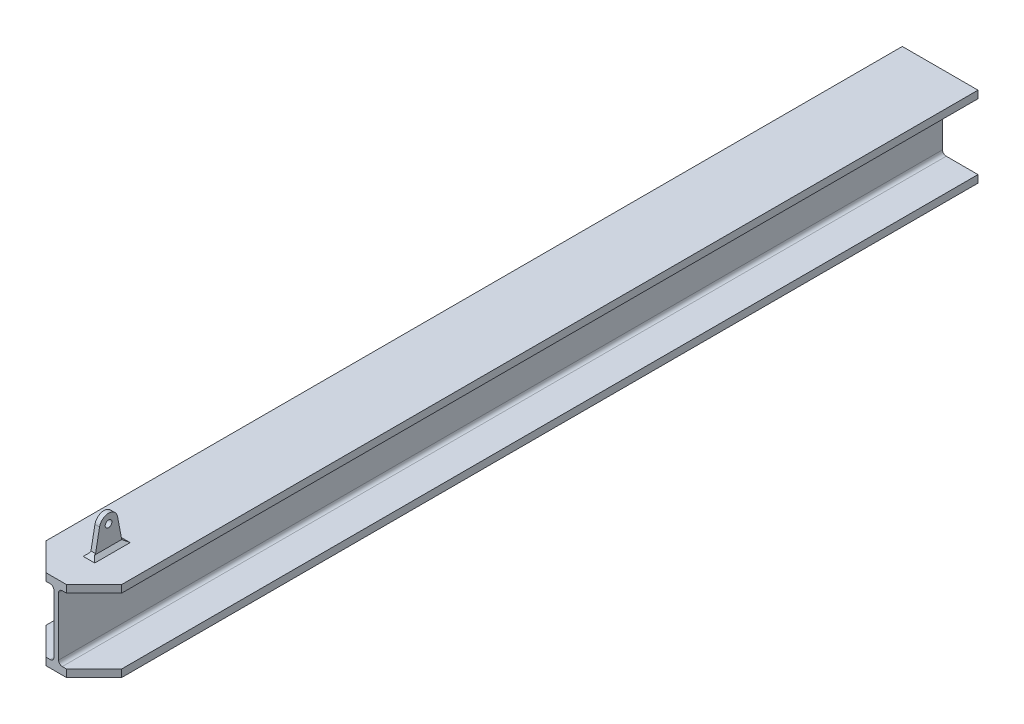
ISO-10303-21;
HEADER;
FILE_DESCRIPTION(('STEP AP214'),'2;1');
FILE_NAME('part.step','',(''),(''),'','','');
FILE_SCHEMA(('AUTOMOTIVE_DESIGN { 1 0 10303 214 1 1 1 1 }'));
ENDSEC;
DATA;
#1=APPLICATION_CONTEXT('core data for automotive mechanical design processes');
#2=APPLICATION_PROTOCOL_DEFINITION('international standard','automotive_design',2000,#1);
#3=PRODUCT_CONTEXT('',#1,'mechanical');
#4=PRODUCT('Part','Part','',(#3));
#5=PRODUCT_RELATED_PRODUCT_CATEGORY('part','',(#4));
#6=PRODUCT_DEFINITION_FORMATION('','',#4);
#7=PRODUCT_DEFINITION_CONTEXT('part definition',#1,'design');
#8=PRODUCT_DEFINITION('design','',#6,#7);
#9=PRODUCT_DEFINITION_SHAPE('','',#8);
#10=(LENGTH_UNIT() NAMED_UNIT(*) SI_UNIT(.MILLI.,.METRE.));
#11=(NAMED_UNIT(*) PLANE_ANGLE_UNIT() SI_UNIT($,.RADIAN.));
#12=(NAMED_UNIT(*) SI_UNIT($,.STERADIAN.) SOLID_ANGLE_UNIT());
#13=UNCERTAINTY_MEASURE_WITH_UNIT(LENGTH_MEASURE(1.E-05),#10,'distance_accuracy_value','');
#14=(GEOMETRIC_REPRESENTATION_CONTEXT(3) GLOBAL_UNCERTAINTY_ASSIGNED_CONTEXT((#13)) GLOBAL_UNIT_ASSIGNED_CONTEXT((#10,
#11,#12)) REPRESENTATION_CONTEXT('',''));
#15=CARTESIAN_POINT('',(0.,0.,0.));
#16=DIRECTION('',(0.,0.,1.));
#17=DIRECTION('',(1.,0.,0.));
#18=AXIS2_PLACEMENT_3D('',#15,#16,#17);
#19=CARTESIAN_POINT('',(-104.394,222.25,2438.4));
#20=DIRECTION('',(0.,-1.,0.));
#21=DIRECTION('',(0.,0.,-1.));
#22=AXIS2_PLACEMENT_3D('',#19,#20,#21);
#23=PLANE('',#22);
#24=DIRECTION('',(-1.,0.,0.));
#25=VECTOR('',#24,1.);
#26=CARTESIAN_POINT('',(-6.34999999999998,222.25,2347.99500927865));
#27=LINE('',#26,#25);
#28=CARTESIAN_POINT('',(15.875,222.25,2347.99500927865));
#29=VERTEX_POINT('',#28);
#30=CARTESIAN_POINT('',(-15.875,222.25,2347.99500927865));
#31=VERTEX_POINT('',#30);
#32=EDGE_CURVE('E727',#29,#31,#27,.T.);
#33=ORIENTED_EDGE('',*,*,#32,.T.);
#34=DIRECTION('',(0.,0.,-1.));
#35=VECTOR('',#34,1.);
#36=CARTESIAN_POINT('',(-15.875,222.25,2438.4));
#37=LINE('',#36,#35);
#38=CARTESIAN_POINT('',(-15.875,222.25,2250.30842317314));
#39=VERTEX_POINT('',#38);
#40=EDGE_CURVE('E731',#31,#39,#37,.T.);
#41=ORIENTED_EDGE('',*,*,#40,.T.);
#42=DIRECTION('',(1.,0.,0.));
#43=VECTOR('',#42,1.);
#44=CARTESIAN_POINT('',(6.34999999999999,222.25,2250.30842317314));
#45=LINE('',#44,#43);
#46=CARTESIAN_POINT('',(15.875,222.25,2250.30842317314));
#47=VERTEX_POINT('',#46);
#48=EDGE_CURVE('E729',#39,#47,#45,.T.);
#49=ORIENTED_EDGE('',*,*,#48,.T.);
#50=DIRECTION('',(0.,0.,1.));
#51=VECTOR('',#50,1.);
#52=CARTESIAN_POINT('',(15.875,222.25,2338.47000927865));
#53=LINE('',#52,#51);
#54=EDGE_CURVE('E725',#47,#29,#53,.T.);
#55=ORIENTED_EDGE('',*,*,#54,.T.);
#56=EDGE_LOOP('',(#33,#41,#49,#55));
#57=FACE_BOUND('',#56,.T.);
#58=DIRECTION('',(-0.707106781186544,0.,-0.707106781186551));
#59=VECTOR('',#58,1.);
#60=CARTESIAN_POINT('',(-66.294,222.25,2400.3));
#61=LINE('',#60,#59);
#62=CARTESIAN_POINT('',(-28.1940000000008,222.25,2438.4));
#63=VERTEX_POINT('',#62);
#64=CARTESIAN_POINT('',(-104.394,222.25,2362.2));
#65=VERTEX_POINT('',#64);
#66=EDGE_CURVE('E607',#63,#65,#61,.T.);
#67=ORIENTED_EDGE('',*,*,#66,.F.);
#68=DIRECTION('',(-1.,0.,0.));
#69=VECTOR('',#68,1.);
#70=CARTESIAN_POINT('',(-104.394,222.25,2438.4));
#71=LINE('',#70,#69);
#72=CARTESIAN_POINT('',(28.1939999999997,222.25,2438.4));
#73=VERTEX_POINT('',#72);
#74=EDGE_CURVE('E663',#73,#63,#71,.T.);
#75=ORIENTED_EDGE('',*,*,#74,.F.);
#76=DIRECTION('',(-0.707106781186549,0.,0.707106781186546));
#77=VECTOR('',#76,1.);
#78=CARTESIAN_POINT('',(-38.1000000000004,222.25,2504.694));
#79=LINE('',#78,#77);
#80=CARTESIAN_POINT('',(104.394,222.25,2362.2));
#81=VERTEX_POINT('',#80);
#82=EDGE_CURVE('E597',#81,#73,#79,.T.);
#83=ORIENTED_EDGE('',*,*,#82,.F.);
#84=DIRECTION('',(0.,0.,-1.));
#85=VECTOR('',#84,1.);
#86=CARTESIAN_POINT('',(104.394,222.25,2438.4));
#87=LINE('',#86,#85);
#88=CARTESIAN_POINT('',(104.394,222.25,0.));
#89=VERTEX_POINT('',#88);
#90=EDGE_CURVE('E697',#81,#89,#87,.T.);
#91=ORIENTED_EDGE('',*,*,#90,.T.);
#92=DIRECTION('',(-1.,0.,0.));
#93=VECTOR('',#92,1.);
#94=CARTESIAN_POINT('',(-104.394,222.25,0.));
#95=LINE('',#94,#93);
#96=CARTESIAN_POINT('',(-104.394,222.25,0.));
#97=VERTEX_POINT('',#96);
#98=EDGE_CURVE('E629',#89,#97,#95,.T.);
#99=ORIENTED_EDGE('',*,*,#98,.T.);
#100=DIRECTION('',(0.,0.,-1.));
#101=VECTOR('',#100,1.);
#102=CARTESIAN_POINT('',(-104.394,222.25,2438.4));
#103=LINE('',#102,#101);
#104=EDGE_CURVE('E695',#65,#97,#103,.T.);
#105=ORIENTED_EDGE('',*,*,#104,.F.);
#106=EDGE_LOOP('',(#67,#75,#83,#91,#99,#105));
#107=FACE_BOUND('',#106,.T.);
#108=ADVANCED_FACE('F361',(#57,#107),#23,.F.);
#109=CARTESIAN_POINT('',(104.394,0.,2438.4));
#110=DIRECTION('',(0.,1.,0.));
#111=DIRECTION('',(-1.,0.,0.));
#112=AXIS2_PLACEMENT_3D('',#109,#110,#111);
#113=PLANE('',#112);
#114=DIRECTION('',(-0.707106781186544,0.,-0.707106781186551));
#115=VECTOR('',#114,1.);
#116=CARTESIAN_POINT('',(-104.394,0.,2362.2));
#117=LINE('',#116,#115);
#118=CARTESIAN_POINT('',(-28.1940000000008,0.,2438.4));
#119=VERTEX_POINT('',#118);
#120=CARTESIAN_POINT('',(-104.394,0.,2362.2));
#121=VERTEX_POINT('',#120);
#122=EDGE_CURVE('E566',#119,#121,#117,.T.);
#123=ORIENTED_EDGE('',*,*,#122,.T.);
#124=DIRECTION('',(0.,0.,-1.));
#125=VECTOR('',#124,1.);
#126=CARTESIAN_POINT('',(-104.394,0.,2438.4));
#127=LINE('',#126,#125);
#128=CARTESIAN_POINT('',(-104.394,0.,0.));
#129=VERTEX_POINT('',#128);
#130=EDGE_CURVE('E677',#121,#129,#127,.T.);
#131=ORIENTED_EDGE('',*,*,#130,.T.);
#132=DIRECTION('',(1.,0.,0.));
#133=VECTOR('',#132,1.);
#134=CARTESIAN_POINT('',(104.394,0.,0.));
#135=LINE('',#134,#133);
#136=CARTESIAN_POINT('',(104.394,0.,0.));
#137=VERTEX_POINT('',#136);
#138=EDGE_CURVE('E609',#129,#137,#135,.T.);
#139=ORIENTED_EDGE('',*,*,#138,.T.);
#140=DIRECTION('',(0.,0.,-1.));
#141=VECTOR('',#140,1.);
#142=CARTESIAN_POINT('',(104.394,0.,2438.4));
#143=LINE('',#142,#141);
#144=CARTESIAN_POINT('',(104.394,0.,2362.2));
#145=VERTEX_POINT('',#144);
#146=EDGE_CURVE('E715',#145,#137,#143,.T.);
#147=ORIENTED_EDGE('',*,*,#146,.F.);
#148=DIRECTION('',(-0.707106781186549,0.,0.707106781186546));
#149=VECTOR('',#148,1.);
#150=CARTESIAN_POINT('',(28.1939999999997,0.,2438.4));
#151=LINE('',#150,#149);
#152=CARTESIAN_POINT('',(28.1939999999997,0.,2438.4));
#153=VERTEX_POINT('',#152);
#154=EDGE_CURVE('E587',#145,#153,#151,.T.);
#155=ORIENTED_EDGE('',*,*,#154,.T.);
#156=DIRECTION('',(1.,0.,0.));
#157=VECTOR('',#156,1.);
#158=CARTESIAN_POINT('',(104.394,0.,2438.4));
#159=LINE('',#158,#157);
#160=EDGE_CURVE('E649',#119,#153,#159,.T.);
#161=ORIENTED_EDGE('',*,*,#160,.F.);
#162=EDGE_LOOP('',(#123,#131,#139,#147,#155,#161));
#163=FACE_BOUND('',#162,.T.);
#164=ADVANCED_FACE('F363',(#163),#113,.F.);
#165=CARTESIAN_POINT('',(104.394,20.574,2438.4));
#166=DIRECTION('',(-1.,0.,0.));
#167=DIRECTION('',(0.,0.,1.));
#168=AXIS2_PLACEMENT_3D('',#165,#166,#167);
#169=PLANE('',#168);
#170=DIRECTION('',(0.,-1.,0.));
#171=VECTOR('',#170,1.);
#172=CARTESIAN_POINT('',(104.394,254.,2362.2));
#173=LINE('',#172,#171);
#174=CARTESIAN_POINT('',(104.394,20.574,2362.2));
#175=VERTEX_POINT('',#174);
#176=EDGE_CURVE('E590',#175,#145,#173,.T.);
#177=ORIENTED_EDGE('',*,*,#176,.T.);
#178=ORIENTED_EDGE('',*,*,#146,.T.);
#179=DIRECTION('',(0.,1.,0.));
#180=VECTOR('',#179,1.);
#181=CARTESIAN_POINT('',(104.394,20.574,0.));
#182=LINE('',#181,#180);
#183=CARTESIAN_POINT('',(104.394,20.574,0.));
#184=VERTEX_POINT('',#183);
#185=EDGE_CURVE('E612',#137,#184,#182,.T.);
#186=ORIENTED_EDGE('',*,*,#185,.T.);
#187=DIRECTION('',(0.,0.,-1.));
#188=VECTOR('',#187,1.);
#189=CARTESIAN_POINT('',(104.394,20.574,2438.4));
#190=LINE('',#189,#188);
#191=EDGE_CURVE('E713',#175,#184,#190,.T.);
#192=ORIENTED_EDGE('',*,*,#191,.F.);
#193=EDGE_LOOP('',(#177,#178,#186,#192));
#194=FACE_BOUND('',#193,.T.);
#195=ADVANCED_FACE('F787',(#194),#169,.F.);
#196=CARTESIAN_POINT('',(16.637,20.574,2438.4));
#197=DIRECTION('',(0.,-1.,0.));
#198=DIRECTION('',(0.,0.,-1.));
#199=AXIS2_PLACEMENT_3D('',#196,#197,#198);
#200=PLANE('',#199);
#201=DIRECTION('',(-0.707106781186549,0.,0.707106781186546));
#202=VECTOR('',#201,1.);
#203=CARTESIAN_POINT('',(22.4154999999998,20.574,2444.1785));
#204=LINE('',#203,#202);
#205=CARTESIAN_POINT('',(28.1939999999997,20.574,2438.4));
#206=VERTEX_POINT('',#205);
#207=EDGE_CURVE('E601',#175,#206,#204,.T.);
#208=ORIENTED_EDGE('',*,*,#207,.F.);
#209=ORIENTED_EDGE('',*,*,#191,.T.);
#210=DIRECTION('',(-1.,0.,0.));
#211=VECTOR('',#210,1.);
#212=CARTESIAN_POINT('',(16.637,20.574,0.));
#213=LINE('',#212,#211);
#214=CARTESIAN_POINT('',(16.637,20.574,0.));
#215=VERTEX_POINT('',#214);
#216=EDGE_CURVE('E615',#184,#215,#213,.T.);
#217=ORIENTED_EDGE('',*,*,#216,.T.);
#218=DIRECTION('',(0.,0.,-1.));
#219=VECTOR('',#218,1.);
#220=CARTESIAN_POINT('',(16.637,20.574,2438.4));
#221=LINE('',#220,#219);
#222=CARTESIAN_POINT('',(16.637,20.574,2438.4));
#223=VERTEX_POINT('',#222);
#224=EDGE_CURVE('E710',#223,#215,#221,.T.);
#225=ORIENTED_EDGE('',*,*,#224,.F.);
#226=DIRECTION('',(-1.,0.,0.));
#227=VECTOR('',#226,1.);
#228=CARTESIAN_POINT('',(16.637,20.574,2438.4));
#229=LINE('',#228,#227);
#230=EDGE_CURVE('E652',#206,#223,#229,.T.);
#231=ORIENTED_EDGE('',*,*,#230,.F.);
#232=EDGE_LOOP('',(#208,#209,#217,#225,#231));
#233=FACE_BOUND('',#232,.T.);
#234=ADVANCED_FACE('F801',(#233),#200,.F.);
#235=CARTESIAN_POINT('',(104.394,201.676,2438.4));
#236=DIRECTION('',(0.,1.,0.));
#237=DIRECTION('',(0.,0.,1.));
#238=AXIS2_PLACEMENT_3D('',#235,#236,#237);
#239=PLANE('',#238);
#240=DIRECTION('',(0.707106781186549,0.,-0.707106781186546));
#241=VECTOR('',#240,1.);
#242=CARTESIAN_POINT('',(66.294,201.676,2400.3));
#243=LINE('',#242,#241);
#244=CARTESIAN_POINT('',(28.1939999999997,201.676,2438.4));
#245=VERTEX_POINT('',#244);
#246=CARTESIAN_POINT('',(104.394,201.676,2362.2));
#247=VERTEX_POINT('',#246);
#248=EDGE_CURVE('E599',#245,#247,#243,.T.);
#249=ORIENTED_EDGE('',*,*,#248,.F.);
#250=DIRECTION('',(1.,0.,0.));
#251=VECTOR('',#250,1.);
#252=CARTESIAN_POINT('',(104.394,201.676,2438.4));
#253=LINE('',#252,#251);
#254=CARTESIAN_POINT('',(16.637,201.676,2438.4));
#255=VERTEX_POINT('',#254);
#256=EDGE_CURVE('E660',#255,#245,#253,.T.);
#257=ORIENTED_EDGE('',*,*,#256,.F.);
#258=DIRECTION('',(0.,0.,-1.));
#259=VECTOR('',#258,1.);
#260=CARTESIAN_POINT('',(16.637,201.676,2438.4));
#261=LINE('',#260,#259);
#262=CARTESIAN_POINT('',(16.637,201.676,0.));
#263=VERTEX_POINT('',#262);
#264=EDGE_CURVE('E701',#255,#263,#261,.T.);
#265=ORIENTED_EDGE('',*,*,#264,.T.);
#266=DIRECTION('',(1.,0.,0.));
#267=VECTOR('',#266,1.);
#268=CARTESIAN_POINT('',(104.394,201.676,0.));
#269=LINE('',#268,#267);
#270=CARTESIAN_POINT('',(104.394,201.676,0.));
#271=VERTEX_POINT('',#270);
#272=EDGE_CURVE('E623',#263,#271,#269,.T.);
#273=ORIENTED_EDGE('',*,*,#272,.T.);
#274=DIRECTION('',(0.,0.,-1.));
#275=VECTOR('',#274,1.);
#276=CARTESIAN_POINT('',(104.394,201.676,2438.4));
#277=LINE('',#276,#275);
#278=EDGE_CURVE('E699',#247,#271,#277,.T.);
#279=ORIENTED_EDGE('',*,*,#278,.F.);
#280=EDGE_LOOP('',(#249,#257,#265,#273,#279));
#281=FACE_BOUND('',#280,.T.);
#282=ADVANCED_FACE('F797',(#281),#239,.F.);
#283=CARTESIAN_POINT('',(104.394,222.25,2438.4));
#284=DIRECTION('',(-1.,0.,0.));
#285=DIRECTION('',(0.,0.,1.));
#286=AXIS2_PLACEMENT_3D('',#283,#284,#285);
#287=PLANE('',#286);
#288=EDGE_CURVE('E593',#81,#247,#173,.T.);
#289=ORIENTED_EDGE('',*,*,#288,.T.);
#290=ORIENTED_EDGE('',*,*,#278,.T.);
#291=DIRECTION('',(0.,1.,0.));
#292=VECTOR('',#291,1.);
#293=CARTESIAN_POINT('',(104.394,222.25,0.));
#294=LINE('',#293,#292);
#295=EDGE_CURVE('E626',#271,#89,#294,.T.);
#296=ORIENTED_EDGE('',*,*,#295,.T.);
#297=ORIENTED_EDGE('',*,*,#90,.F.);
#298=EDGE_LOOP('',(#289,#290,#296,#297));
#299=FACE_BOUND('',#298,.T.);
#300=ADVANCED_FACE('F794',(#299),#287,.F.);
#301=CARTESIAN_POINT('',(-104.394,201.676,2438.4));
#302=DIRECTION('',(1.,0.,0.));
#303=DIRECTION('',(0.,0.,-1.));
#304=AXIS2_PLACEMENT_3D('',#301,#302,#303);
#305=PLANE('',#304);
#306=DIRECTION('',(0.,-1.,0.));
#307=VECTOR('',#306,1.);
#308=CARTESIAN_POINT('',(-104.394,254.,2362.2));
#309=LINE('',#308,#307);
#310=CARTESIAN_POINT('',(-104.394,201.676,2362.2));
#311=VERTEX_POINT('',#310);
#312=EDGE_CURVE('E596',#65,#311,#309,.T.);
#313=ORIENTED_EDGE('',*,*,#312,.F.);
#314=ORIENTED_EDGE('',*,*,#104,.T.);
#315=DIRECTION('',(0.,-1.,0.));
#316=VECTOR('',#315,1.);
#317=CARTESIAN_POINT('',(-104.394,201.676,0.));
#318=LINE('',#317,#316);
#319=CARTESIAN_POINT('',(-104.394,201.676,0.));
#320=VERTEX_POINT('',#319);
#321=EDGE_CURVE('E632',#97,#320,#318,.T.);
#322=ORIENTED_EDGE('',*,*,#321,.T.);
#323=DIRECTION('',(0.,0.,-1.));
#324=VECTOR('',#323,1.);
#325=CARTESIAN_POINT('',(-104.394,201.676,2438.4));
#326=LINE('',#325,#324);
#327=EDGE_CURVE('E693',#311,#320,#326,.T.);
#328=ORIENTED_EDGE('',*,*,#327,.F.);
#329=EDGE_LOOP('',(#313,#314,#322,#328));
#330=FACE_BOUND('',#329,.T.);
#331=ADVANCED_FACE('F792',(#330),#305,.F.);
#332=CARTESIAN_POINT('',(-16.637,201.676,2438.4));
#333=DIRECTION('',(0.,1.,0.));
#334=DIRECTION('',(0.,0.,1.));
#335=AXIS2_PLACEMENT_3D('',#332,#333,#334);
#336=PLANE('',#335);
#337=DIRECTION('',(0.707106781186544,0.,0.707106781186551));
#338=VECTOR('',#337,1.);
#339=CARTESIAN_POINT('',(-22.4155000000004,201.676,2444.1785));
#340=LINE('',#339,#338);
#341=CARTESIAN_POINT('',(-28.1940000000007,201.676,2438.4));
#342=VERTEX_POINT('',#341);
#343=EDGE_CURVE('E605',#311,#342,#340,.T.);
#344=ORIENTED_EDGE('',*,*,#343,.F.);
#345=ORIENTED_EDGE('',*,*,#327,.T.);
#346=DIRECTION('',(1.,0.,0.));
#347=VECTOR('',#346,1.);
#348=CARTESIAN_POINT('',(-16.637,201.676,0.));
#349=LINE('',#348,#347);
#350=CARTESIAN_POINT('',(-16.637,201.676,0.));
#351=VERTEX_POINT('',#350);
#352=EDGE_CURVE('E635',#320,#351,#349,.T.);
#353=ORIENTED_EDGE('',*,*,#352,.T.);
#354=DIRECTION('',(0.,0.,-1.));
#355=VECTOR('',#354,1.);
#356=CARTESIAN_POINT('',(-16.637,201.676,2438.4));
#357=LINE('',#356,#355);
#358=CARTESIAN_POINT('',(-16.637,201.676,2438.4));
#359=VERTEX_POINT('',#358);
#360=EDGE_CURVE('E690',#359,#351,#357,.T.);
#361=ORIENTED_EDGE('',*,*,#360,.F.);
#362=DIRECTION('',(1.,0.,0.));
#363=VECTOR('',#362,1.);
#364=CARTESIAN_POINT('',(-16.637,201.676,2438.4));
#365=LINE('',#364,#363);
#366=EDGE_CURVE('E666',#342,#359,#365,.T.);
#367=ORIENTED_EDGE('',*,*,#366,.F.);
#368=EDGE_LOOP('',(#344,#345,#353,#361,#367));
#369=FACE_BOUND('',#368,.T.);
#370=ADVANCED_FACE('F871',(#369),#336,.F.);
#371=CARTESIAN_POINT('',(-104.394,20.574,2438.4));
#372=DIRECTION('',(0.,-1.,0.));
#373=DIRECTION('',(1.,0.,0.));
#374=AXIS2_PLACEMENT_3D('',#371,#372,#373);
#375=PLANE('',#374);
#376=DIRECTION('',(-0.707106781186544,0.,-0.707106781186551));
#377=VECTOR('',#376,1.);
#378=CARTESIAN_POINT('',(-66.294,20.574,2400.3));
#379=LINE('',#378,#377);
#380=CARTESIAN_POINT('',(-28.1940000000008,20.574,2438.4));
#381=VERTEX_POINT('',#380);
#382=CARTESIAN_POINT('',(-104.394,20.574,2362.2));
#383=VERTEX_POINT('',#382);
#384=EDGE_CURVE('E603',#381,#383,#379,.T.);
#385=ORIENTED_EDGE('',*,*,#384,.F.);
#386=DIRECTION('',(-1.,0.,0.));
#387=VECTOR('',#386,1.);
#388=CARTESIAN_POINT('',(-104.394,20.574,2438.4));
#389=LINE('',#388,#387);
#390=CARTESIAN_POINT('',(-16.637,20.574,2438.4));
#391=VERTEX_POINT('',#390);
#392=EDGE_CURVE('E674',#391,#381,#389,.T.);
#393=ORIENTED_EDGE('',*,*,#392,.F.);
#394=DIRECTION('',(0.,0.,-1.));
#395=VECTOR('',#394,1.);
#396=CARTESIAN_POINT('',(-16.637,20.574,2438.4));
#397=LINE('',#396,#395);
#398=CARTESIAN_POINT('',(-16.637,20.574,0.));
#399=VERTEX_POINT('',#398);
#400=EDGE_CURVE('E681',#391,#399,#397,.T.);
#401=ORIENTED_EDGE('',*,*,#400,.T.);
#402=DIRECTION('',(-1.,0.,0.));
#403=VECTOR('',#402,1.);
#404=CARTESIAN_POINT('',(-104.394,20.574,0.));
#405=LINE('',#404,#403);
#406=CARTESIAN_POINT('',(-104.394,20.574,0.));
#407=VERTEX_POINT('',#406);
#408=EDGE_CURVE('E643',#399,#407,#405,.T.);
#409=ORIENTED_EDGE('',*,*,#408,.T.);
#410=DIRECTION('',(0.,0.,-1.));
#411=VECTOR('',#410,1.);
#412=CARTESIAN_POINT('',(-104.394,20.574,2438.4));
#413=LINE('',#412,#411);
#414=EDGE_CURVE('E679',#383,#407,#413,.T.);
#415=ORIENTED_EDGE('',*,*,#414,.F.);
#416=EDGE_LOOP('',(#385,#393,#401,#409,#415));
#417=FACE_BOUND('',#416,.T.);
#418=ADVANCED_FACE('F867',(#417),#375,.F.);
#419=CARTESIAN_POINT('',(-104.394,0.,2438.4));
#420=DIRECTION('',(1.,0.,0.));
#421=DIRECTION('',(0.,0.,-1.));
#422=AXIS2_PLACEMENT_3D('',#419,#420,#421);
#423=PLANE('',#422);
#424=EDGE_CURVE('E594',#383,#121,#309,.T.);
#425=ORIENTED_EDGE('',*,*,#424,.F.);
#426=ORIENTED_EDGE('',*,*,#414,.T.);
#427=DIRECTION('',(0.,-1.,0.));
#428=VECTOR('',#427,1.);
#429=CARTESIAN_POINT('',(-104.394,0.,0.));
#430=LINE('',#429,#428);
#431=EDGE_CURVE('E646',#407,#129,#430,.T.);
#432=ORIENTED_EDGE('',*,*,#431,.T.);
#433=ORIENTED_EDGE('',*,*,#130,.F.);
#434=EDGE_LOOP('',(#425,#426,#432,#433));
#435=FACE_BOUND('',#434,.T.);
#436=ADVANCED_FACE('F864',(#435),#423,.F.);
#437=CARTESIAN_POINT('',(-16.637,30.734,2438.4));
#438=DIRECTION('',(0.,0.,1.));
#439=DIRECTION('',(1.,0.,0.));
#440=AXIS2_PLACEMENT_3D('',#437,#438,#439);
#441=PLANE('',#440);
#442=ORIENTED_EDGE('',*,*,#74,.T.);
#443=DIRECTION('',(0.,-1.,0.));
#444=VECTOR('',#443,1.);
#445=CARTESIAN_POINT('',(-28.1940000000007,30.734,2438.4));
#446=LINE('',#445,#444);
#447=EDGE_CURVE('E724',#63,#342,#446,.T.);
#448=ORIENTED_EDGE('',*,*,#447,.T.);
#449=ORIENTED_EDGE('',*,*,#366,.T.);
#450=CARTESIAN_POINT('',(-16.637,191.516,2438.4));
#451=DIRECTION('',(0.,0.,-1.));
#452=DIRECTION('',(1.,0.,0.));
#453=AXIS2_PLACEMENT_3D('',#450,#451,#452);
#454=CIRCLE('',#453,10.16);
#455=CARTESIAN_POINT('',(-6.47699999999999,191.516,2438.4));
#456=VERTEX_POINT('',#455);
#457=EDGE_CURVE('E668',#359,#456,#454,.T.);
#458=ORIENTED_EDGE('',*,*,#457,.T.);
#459=DIRECTION('',(0.,-1.,0.));
#460=VECTOR('',#459,1.);
#461=CARTESIAN_POINT('',(-6.47699999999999,30.734,2438.4));
#462=LINE('',#461,#460);
#463=CARTESIAN_POINT('',(-6.47699999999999,30.734,2438.4));
#464=VERTEX_POINT('',#463);
#465=EDGE_CURVE('E670',#456,#464,#462,.T.);
#466=ORIENTED_EDGE('',*,*,#465,.T.);
#467=CARTESIAN_POINT('',(-16.637,30.734,2438.4));
#468=DIRECTION('',(0.,0.,-1.));
#469=DIRECTION('',(1.,0.,0.));
#470=AXIS2_PLACEMENT_3D('',#467,#468,#469);
#471=CIRCLE('',#470,10.16);
#472=EDGE_CURVE('E672',#464,#391,#471,.T.);
#473=ORIENTED_EDGE('',*,*,#472,.T.);
#474=ORIENTED_EDGE('',*,*,#392,.T.);
#475=EDGE_CURVE('E721',#381,#119,#446,.T.);
#476=ORIENTED_EDGE('',*,*,#475,.T.);
#477=ORIENTED_EDGE('',*,*,#160,.T.);
#478=DIRECTION('',(0.,1.,0.));
#479=VECTOR('',#478,1.);
#480=CARTESIAN_POINT('',(28.1939999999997,30.734,2438.4));
#481=LINE('',#480,#479);
#482=EDGE_CURVE('E720',#153,#206,#481,.T.);
#483=ORIENTED_EDGE('',*,*,#482,.T.);
#484=ORIENTED_EDGE('',*,*,#230,.T.);
#485=CARTESIAN_POINT('',(16.637,30.734,2438.4));
#486=DIRECTION('',(0.,0.,-1.));
#487=DIRECTION('',(1.,0.,0.));
#488=AXIS2_PLACEMENT_3D('',#485,#486,#487);
#489=CIRCLE('',#488,10.16);
#490=CARTESIAN_POINT('',(6.477,30.734,2438.4));
#491=VERTEX_POINT('',#490);
#492=EDGE_CURVE('E654',#223,#491,#489,.T.);
#493=ORIENTED_EDGE('',*,*,#492,.T.);
#494=DIRECTION('',(0.,1.,0.));
#495=VECTOR('',#494,1.);
#496=CARTESIAN_POINT('',(6.477,191.516,2438.4));
#497=LINE('',#496,#495);
#498=CARTESIAN_POINT('',(6.477,191.516,2438.4));
#499=VERTEX_POINT('',#498);
#500=EDGE_CURVE('E656',#491,#499,#497,.T.);
#501=ORIENTED_EDGE('',*,*,#500,.T.);
#502=CARTESIAN_POINT('',(16.637,191.516,2438.4));
#503=DIRECTION('',(0.,0.,-1.));
#504=DIRECTION('',(1.,0.,0.));
#505=AXIS2_PLACEMENT_3D('',#502,#503,#504);
#506=CIRCLE('',#505,10.16);
#507=EDGE_CURVE('E658',#499,#255,#506,.T.);
#508=ORIENTED_EDGE('',*,*,#507,.T.);
#509=ORIENTED_EDGE('',*,*,#256,.T.);
#510=EDGE_CURVE('E717',#245,#73,#481,.T.);
#511=ORIENTED_EDGE('',*,*,#510,.T.);
#512=EDGE_LOOP('',(#442,#448,#449,#458,#466,#473,#474,#476,#477,#483,#484,#493,#501,#508,#509,#511));
#513=FACE_BOUND('',#512,.T.);
#514=ADVANCED_FACE('F815',(#513),#441,.T.);
#515=CARTESIAN_POINT('',(16.637,30.734,2438.4));
#516=DIRECTION('',(0.,0.,-1.));
#517=DIRECTION('',(-1.,0.,0.));
#518=AXIS2_PLACEMENT_3D('',#515,#516,#517);
#519=CYLINDRICAL_SURFACE('',#518,10.16);
#520=CARTESIAN_POINT('',(16.637,30.734,0.));
#521=DIRECTION('',(0.,0.,-1.));
#522=DIRECTION('',(1.,0.,0.));
#523=AXIS2_PLACEMENT_3D('',#520,#521,#522);
#524=CIRCLE('',#523,10.16);
#525=CARTESIAN_POINT('',(6.477,30.734,0.));
#526=VERTEX_POINT('',#525);
#527=EDGE_CURVE('E617',#215,#526,#524,.T.);
#528=ORIENTED_EDGE('',*,*,#527,.T.);
#529=DIRECTION('',(0.,0.,-1.));
#530=VECTOR('',#529,1.);
#531=CARTESIAN_POINT('',(6.477,30.734,2438.4));
#532=LINE('',#531,#530);
#533=EDGE_CURVE('E707',#491,#526,#532,.T.);
#534=ORIENTED_EDGE('',*,*,#533,.F.);
#535=ORIENTED_EDGE('',*,*,#492,.F.);
#536=ORIENTED_EDGE('',*,*,#224,.T.);
#537=EDGE_LOOP('',(#528,#534,#535,#536));
#538=FACE_BOUND('',#537,.T.);
#539=ADVANCED_FACE('F811',(#538),#519,.F.);
#540=CARTESIAN_POINT('',(6.477,191.516,2438.4));
#541=DIRECTION('',(-1.,0.,0.));
#542=DIRECTION('',(0.,0.,1.));
#543=AXIS2_PLACEMENT_3D('',#540,#541,#542);
#544=PLANE('',#543);
#545=DIRECTION('',(0.,1.,0.));
#546=VECTOR('',#545,1.);
#547=CARTESIAN_POINT('',(6.477,191.516,0.));
#548=LINE('',#547,#546);
#549=CARTESIAN_POINT('',(6.477,191.516,0.));
#550=VERTEX_POINT('',#549);
#551=EDGE_CURVE('E619',#526,#550,#548,.T.);
#552=ORIENTED_EDGE('',*,*,#551,.T.);
#553=DIRECTION('',(0.,0.,-1.));
#554=VECTOR('',#553,1.);
#555=CARTESIAN_POINT('',(6.477,191.516,2438.4));
#556=LINE('',#555,#554);
#557=EDGE_CURVE('E704',#499,#550,#556,.T.);
#558=ORIENTED_EDGE('',*,*,#557,.F.);
#559=ORIENTED_EDGE('',*,*,#500,.F.);
#560=ORIENTED_EDGE('',*,*,#533,.T.);
#561=EDGE_LOOP('',(#552,#558,#559,#560));
#562=FACE_BOUND('',#561,.T.);
#563=ADVANCED_FACE('F807',(#562),#544,.F.);
#564=CARTESIAN_POINT('',(16.637,191.516,2438.4));
#565=DIRECTION('',(0.,0.,-1.));
#566=DIRECTION('',(-1.,0.,0.));
#567=AXIS2_PLACEMENT_3D('',#564,#565,#566);
#568=CYLINDRICAL_SURFACE('',#567,10.16);
#569=CARTESIAN_POINT('',(16.637,191.516,0.));
#570=DIRECTION('',(0.,0.,-1.));
#571=DIRECTION('',(1.,0.,0.));
#572=AXIS2_PLACEMENT_3D('',#569,#570,#571);
#573=CIRCLE('',#572,10.16);
#574=EDGE_CURVE('E621',#550,#263,#573,.T.);
#575=ORIENTED_EDGE('',*,*,#574,.T.);
#576=ORIENTED_EDGE('',*,*,#264,.F.);
#577=ORIENTED_EDGE('',*,*,#507,.F.);
#578=ORIENTED_EDGE('',*,*,#557,.T.);
#579=EDGE_LOOP('',(#575,#576,#577,#578));
#580=FACE_BOUND('',#579,.T.);
#581=ADVANCED_FACE('F803',(#580),#568,.F.);
#582=CARTESIAN_POINT('',(-16.637,191.516,2438.4));
#583=DIRECTION('',(0.,0.,-1.));
#584=DIRECTION('',(-1.,0.,0.));
#585=AXIS2_PLACEMENT_3D('',#582,#583,#584);
#586=CYLINDRICAL_SURFACE('',#585,10.16);
#587=CARTESIAN_POINT('',(-16.637,191.516,0.));
#588=DIRECTION('',(0.,0.,-1.));
#589=DIRECTION('',(1.,0.,0.));
#590=AXIS2_PLACEMENT_3D('',#587,#588,#589);
#591=CIRCLE('',#590,10.16);
#592=CARTESIAN_POINT('',(-6.47699999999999,191.516,0.));
#593=VERTEX_POINT('',#592);
#594=EDGE_CURVE('E637',#351,#593,#591,.T.);
#595=ORIENTED_EDGE('',*,*,#594,.T.);
#596=DIRECTION('',(0.,0.,-1.));
#597=VECTOR('',#596,1.);
#598=CARTESIAN_POINT('',(-6.47699999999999,191.516,2438.4));
#599=LINE('',#598,#597);
#600=EDGE_CURVE('E687',#456,#593,#599,.T.);
#601=ORIENTED_EDGE('',*,*,#600,.F.);
#602=ORIENTED_EDGE('',*,*,#457,.F.);
#603=ORIENTED_EDGE('',*,*,#360,.T.);
#604=EDGE_LOOP('',(#595,#601,#602,#603));
#605=FACE_BOUND('',#604,.T.);
#606=ADVANCED_FACE('F806',(#605),#586,.F.);
#607=CARTESIAN_POINT('',(-6.47699999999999,30.734,2438.4));
#608=DIRECTION('',(1.,0.,0.));
#609=DIRECTION('',(0.,1.,0.));
#610=AXIS2_PLACEMENT_3D('',#607,#608,#609);
#611=PLANE('',#610);
#612=DIRECTION('',(0.,-1.,0.));
#613=VECTOR('',#612,1.);
#614=CARTESIAN_POINT('',(-6.47699999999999,30.734,0.));
#615=LINE('',#614,#613);
#616=CARTESIAN_POINT('',(-6.47699999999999,30.734,0.));
#617=VERTEX_POINT('',#616);
#618=EDGE_CURVE('E639',#593,#617,#615,.T.);
#619=ORIENTED_EDGE('',*,*,#618,.T.);
#620=DIRECTION('',(0.,0.,-1.));
#621=VECTOR('',#620,1.);
#622=CARTESIAN_POINT('',(-6.47699999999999,30.734,2438.4));
#623=LINE('',#622,#621);
#624=EDGE_CURVE('E684',#464,#617,#623,.T.);
#625=ORIENTED_EDGE('',*,*,#624,.F.);
#626=ORIENTED_EDGE('',*,*,#465,.F.);
#627=ORIENTED_EDGE('',*,*,#600,.T.);
#628=EDGE_LOOP('',(#619,#625,#626,#627));
#629=FACE_BOUND('',#628,.T.);
#630=ADVANCED_FACE('F875',(#629),#611,.F.);
#631=CARTESIAN_POINT('',(-16.637,30.734,2438.4));
#632=DIRECTION('',(0.,0.,-1.));
#633=DIRECTION('',(-1.,0.,0.));
#634=AXIS2_PLACEMENT_3D('',#631,#632,#633);
#635=CYLINDRICAL_SURFACE('',#634,10.16);
#636=CARTESIAN_POINT('',(-16.637,30.734,0.));
#637=DIRECTION('',(0.,0.,-1.));
#638=DIRECTION('',(1.,0.,0.));
#639=AXIS2_PLACEMENT_3D('',#636,#637,#638);
#640=CIRCLE('',#639,10.16);
#641=EDGE_CURVE('E641',#617,#399,#640,.T.);
#642=ORIENTED_EDGE('',*,*,#641,.T.);
#643=ORIENTED_EDGE('',*,*,#400,.F.);
#644=ORIENTED_EDGE('',*,*,#472,.F.);
#645=ORIENTED_EDGE('',*,*,#624,.T.);
#646=EDGE_LOOP('',(#642,#643,#644,#645));
#647=FACE_BOUND('',#646,.T.);
#648=ADVANCED_FACE('F861',(#647),#635,.F.);
#649=CARTESIAN_POINT('',(-16.637,30.734,0.));
#650=DIRECTION('',(0.,0.,1.));
#651=DIRECTION('',(1.,0.,0.));
#652=AXIS2_PLACEMENT_3D('',#649,#650,#651);
#653=PLANE('',#652);
#654=ORIENTED_EDGE('',*,*,#138,.F.);
#655=ORIENTED_EDGE('',*,*,#431,.F.);
#656=ORIENTED_EDGE('',*,*,#408,.F.);
#657=ORIENTED_EDGE('',*,*,#641,.F.);
#658=ORIENTED_EDGE('',*,*,#618,.F.);
#659=ORIENTED_EDGE('',*,*,#594,.F.);
#660=ORIENTED_EDGE('',*,*,#352,.F.);
#661=ORIENTED_EDGE('',*,*,#321,.F.);
#662=ORIENTED_EDGE('',*,*,#98,.F.);
#663=ORIENTED_EDGE('',*,*,#295,.F.);
#664=ORIENTED_EDGE('',*,*,#272,.F.);
#665=ORIENTED_EDGE('',*,*,#574,.F.);
#666=ORIENTED_EDGE('',*,*,#551,.F.);
#667=ORIENTED_EDGE('',*,*,#527,.F.);
#668=ORIENTED_EDGE('',*,*,#216,.F.);
#669=ORIENTED_EDGE('',*,*,#185,.F.);
#670=EDGE_LOOP('',(#654,#655,#656,#657,#658,#659,#660,#661,#662,#663,#664,#665,#666,#667,#668,#669));
#671=FACE_BOUND('',#670,.T.);
#672=ADVANCED_FACE('F833',(#671),#653,.F.);
#673=CARTESIAN_POINT('',(28.1939999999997,254.,2438.4));
#674=DIRECTION('',(0.707106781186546,0.,0.707106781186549));
#675=DIRECTION('',(0.707106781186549,0.,-0.707106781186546));
#676=AXIS2_PLACEMENT_3D('',#673,#674,#675);
#677=PLANE('',#676);
#678=ORIENTED_EDGE('',*,*,#248,.T.);
#679=ORIENTED_EDGE('',*,*,#288,.F.);
#680=ORIENTED_EDGE('',*,*,#82,.T.);
#681=ORIENTED_EDGE('',*,*,#510,.F.);
#682=EDGE_LOOP('',(#678,#679,#680,#681));
#683=FACE_BOUND('',#682,.T.);
#684=ADVANCED_FACE('F848',(#683),#677,.T.);
#685=ORIENTED_EDGE('',*,*,#207,.T.);
#686=ORIENTED_EDGE('',*,*,#482,.F.);
#687=ORIENTED_EDGE('',*,*,#154,.F.);
#688=ORIENTED_EDGE('',*,*,#176,.F.);
#689=EDGE_LOOP('',(#685,#686,#687,#688));
#690=FACE_BOUND('',#689,.T.);
#691=ADVANCED_FACE('F846',(#690),#677,.T.);
#692=CARTESIAN_POINT('',(-104.394,254.,2362.2));
#693=DIRECTION('',(-0.707106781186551,0.,0.707106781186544));
#694=DIRECTION('',(0.707106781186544,0.,0.707106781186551));
#695=AXIS2_PLACEMENT_3D('',#692,#693,#694);
#696=PLANE('',#695);
#697=ORIENTED_EDGE('',*,*,#384,.T.);
#698=ORIENTED_EDGE('',*,*,#424,.T.);
#699=ORIENTED_EDGE('',*,*,#122,.F.);
#700=ORIENTED_EDGE('',*,*,#475,.F.);
#701=EDGE_LOOP('',(#697,#698,#699,#700));
#702=FACE_BOUND('',#701,.T.);
#703=ADVANCED_FACE('F777',(#702),#696,.T.);
#704=ORIENTED_EDGE('',*,*,#66,.T.);
#705=ORIENTED_EDGE('',*,*,#312,.T.);
#706=ORIENTED_EDGE('',*,*,#343,.T.);
#707=ORIENTED_EDGE('',*,*,#447,.F.);
#708=EDGE_LOOP('',(#704,#705,#706,#707));
#709=FACE_BOUND('',#708,.T.);
#710=ADVANCED_FACE('F769',(#709),#696,.T.);
#711=CARTESIAN_POINT('',(6.35,287.365619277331,2300.37000927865));
#712=DIRECTION('',(-1.,0.,0.));
#713=DIRECTION('',(0.,0.,1.));
#714=AXIS2_PLACEMENT_3D('',#711,#712,#713);
#715=PLANE('',#714);
#716=DIRECTION('',(0.,0.707106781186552,-0.707106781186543));
#717=VECTOR('',#716,1.);
#718=CARTESIAN_POINT('',(6.35,278.620309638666,2291.62469963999));
#719=LINE('',#718,#717);
#720=CARTESIAN_POINT('',(6.35,234.002375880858,2336.24263339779));
#721=VERTEX_POINT('',#720);
#722=CARTESIAN_POINT('',(6.35,231.775,2338.47000927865));
#723=VERTEX_POINT('',#722);
#724=EDGE_CURVE('E369',#721,#723,#719,.F.);
#725=ORIENTED_EDGE('',*,*,#724,.T.);
#726=DIRECTION('',(0.,0.,-1.));
#727=VECTOR('',#726,1.);
#728=CARTESIAN_POINT('',(6.35,231.775,2262.27000927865));
#729=LINE('',#728,#727);
#730=CARTESIAN_POINT('',(6.35,231.775,2264.07524044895));
#731=VERTEX_POINT('',#730);
#732=EDGE_CURVE('E376',#723,#731,#729,.T.);
#733=ORIENTED_EDGE('',*,*,#732,.T.);
#734=DIRECTION('',(0.,0.982509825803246,0.186210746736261));
#735=VECTOR('',#734,1.);
#736=CARTESIAN_POINT('',(6.35,292.078314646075,2275.50426126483));
#737=LINE('',#736,#735);
#738=CARTESIAN_POINT('',(6.35,292.078314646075,2275.50426126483));
#739=VERTEX_POINT('',#738);
#740=EDGE_CURVE('E575',#731,#739,#737,.T.);
#741=ORIENTED_EDGE('',*,*,#740,.T.);
#742=CARTESIAN_POINT('',(6.35,287.365619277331,2300.37000927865));
#743=DIRECTION('',(1.,0.,0.));
#744=DIRECTION('',(0.,0.,1.));
#745=AXIS2_PLACEMENT_3D('',#742,#743,#744);
#746=CIRCLE('',#745,25.3083962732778);
#747=CARTESIAN_POINT('',(6.35,292.078314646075,2325.23575729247));
#748=VERTEX_POINT('',#747);
#749=EDGE_CURVE('E565',#739,#748,#746,.T.);
#750=ORIENTED_EDGE('',*,*,#749,.T.);
#751=DIRECTION('',(0.,-0.982509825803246,0.186210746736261));
#752=VECTOR('',#751,1.);
#753=CARTESIAN_POINT('',(6.35,222.25,2338.47000927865));
#754=LINE('',#753,#752);
#755=EDGE_CURVE('E581',#748,#721,#754,.T.);
#756=ORIENTED_EDGE('',*,*,#755,.T.);
#757=EDGE_LOOP('',(#725,#733,#741,#750,#756));
#758=FACE_BOUND('',#757,.T.);
#759=CARTESIAN_POINT('',(6.35,287.365619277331,2300.37000927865));
#760=DIRECTION('',(1.,0.,0.));
#761=DIRECTION('',(0.,0.,-1.));
#762=AXIS2_PLACEMENT_3D('',#759,#760,#761);
#763=CIRCLE('',#762,9.30936861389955);
#764=CARTESIAN_POINT('',(6.35,287.365619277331,2291.06064066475));
#765=VERTEX_POINT('',#764);
#766=EDGE_CURVE('E559',#765,#765,#763,.T.);
#767=ORIENTED_EDGE('',*,*,#766,.F.);
#768=EDGE_LOOP('',(#767));
#769=FACE_BOUND('',#768,.T.);
#770=ADVANCED_FACE('F745',(#758,#769),#715,.F.);
#771=CARTESIAN_POINT('',(-6.35,287.365619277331,2300.37000927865));
#772=DIRECTION('',(-1.,0.,0.));
#773=DIRECTION('',(0.,0.,1.));
#774=AXIS2_PLACEMENT_3D('',#771,#772,#773);
#775=PLANE('',#774);
#776=DIRECTION('',(0.,0.982509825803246,0.186210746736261));
#777=VECTOR('',#776,1.);
#778=CARTESIAN_POINT('',(-6.35,292.078314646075,2275.50426126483));
#779=LINE('',#778,#777);
#780=CARTESIAN_POINT('',(-6.35,231.775,2264.07524044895));
#781=VERTEX_POINT('',#780);
#782=CARTESIAN_POINT('',(-6.35,292.078314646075,2275.50426126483));
#783=VERTEX_POINT('',#782);
#784=EDGE_CURVE('E547',#781,#783,#779,.T.);
#785=ORIENTED_EDGE('',*,*,#784,.F.);
#786=DIRECTION('',(0.,0.,1.));
#787=VECTOR('',#786,1.);
#788=CARTESIAN_POINT('',(-6.35,231.775,2300.37000927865));
#789=LINE('',#788,#787);
#790=CARTESIAN_POINT('',(-6.35,231.775,2338.47000927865));
#791=VERTEX_POINT('',#790);
#792=EDGE_CURVE('E734',#781,#791,#789,.T.);
#793=ORIENTED_EDGE('',*,*,#792,.T.);
#794=DIRECTION('',(0.,-0.707106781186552,0.707106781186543));
#795=VECTOR('',#794,1.);
#796=CARTESIAN_POINT('',(-6.34999999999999,222.25,2347.99500927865));
#797=LINE('',#796,#795);
#798=CARTESIAN_POINT('',(-6.35,234.002375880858,2336.24263339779));
#799=VERTEX_POINT('',#798);
#800=EDGE_CURVE('E741',#791,#799,#797,.F.);
#801=ORIENTED_EDGE('',*,*,#800,.T.);
#802=DIRECTION('',(0.,-0.982509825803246,0.186210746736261));
#803=VECTOR('',#802,1.);
#804=CARTESIAN_POINT('',(-6.35,222.25,2338.47000927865));
#805=LINE('',#804,#803);
#806=CARTESIAN_POINT('',(-6.35,292.078314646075,2325.23575729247));
#807=VERTEX_POINT('',#806);
#808=EDGE_CURVE('E573',#807,#799,#805,.T.);
#809=ORIENTED_EDGE('',*,*,#808,.F.);
#810=CARTESIAN_POINT('',(-6.35,287.365619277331,2300.37000927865));
#811=DIRECTION('',(1.,0.,0.));
#812=DIRECTION('',(0.,0.,1.));
#813=AXIS2_PLACEMENT_3D('',#810,#811,#812);
#814=CIRCLE('',#813,25.3083962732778);
#815=EDGE_CURVE('E558',#783,#807,#814,.T.);
#816=ORIENTED_EDGE('',*,*,#815,.F.);
#817=EDGE_LOOP('',(#785,#793,#801,#809,#816));
#818=FACE_BOUND('',#817,.T.);
#819=CARTESIAN_POINT('',(-6.35,287.365619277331,2300.37000927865));
#820=DIRECTION('',(1.,0.,0.));
#821=DIRECTION('',(0.,0.,-1.));
#822=AXIS2_PLACEMENT_3D('',#819,#820,#821);
#823=CIRCLE('',#822,9.30936861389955);
#824=CARTESIAN_POINT('',(-6.35,287.365619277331,2291.06064066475));
#825=VERTEX_POINT('',#824);
#826=EDGE_CURVE('E755',#825,#825,#823,.T.);
#827=ORIENTED_EDGE('',*,*,#826,.T.);
#828=EDGE_LOOP('',(#827));
#829=FACE_BOUND('',#828,.T.);
#830=ADVANCED_FACE('F570',(#818,#829),#775,.T.);
#831=CARTESIAN_POINT('',(6.35,292.078314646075,2275.50426126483));
#832=DIRECTION('',(0.,-0.186210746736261,0.982509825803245));
#833=DIRECTION('',(0.,-0.982509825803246,-0.186210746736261));
#834=AXIS2_PLACEMENT_3D('',#831,#832,#833);
#835=PLANE('',#834);
#836=ORIENTED_EDGE('',*,*,#740,.F.);
#837=DIRECTION('',(-0.700841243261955,0.700841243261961,0.132827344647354));
#838=VECTOR('',#837,1.);
#839=CARTESIAN_POINT('',(-24.3336261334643,262.458626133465,2269.89057255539));
#840=LINE('',#839,#838);
#841=CARTESIAN_POINT('',(6.5165939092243,231.608406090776,2264.04366664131));
#842=VERTEX_POINT('',#841);
#843=EDGE_CURVE('E11',#731,#842,#840,.F.);
#844=ORIENTED_EDGE('',*,*,#843,.T.);
#845=DIRECTION('',(-1.,0.,0.));
#846=VECTOR('',#845,1.);
#847=CARTESIAN_POINT('',(-6.34999999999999,231.608406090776,2264.04366664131));
#848=LINE('',#847,#846);
#849=CARTESIAN_POINT('',(-6.5165939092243,231.608406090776,2264.04366664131));
#850=VERTEX_POINT('',#849);
#851=EDGE_CURVE('E384',#842,#850,#848,.T.);
#852=ORIENTED_EDGE('',*,*,#851,.T.);
#853=DIRECTION('',(0.700841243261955,0.700841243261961,0.132827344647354));
#854=VECTOR('',#853,1.);
#855=CARTESIAN_POINT('',(30.5715924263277,268.696592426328,2271.07282674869));
#856=LINE('',#855,#854);
#857=EDGE_CURVE('E554',#850,#781,#856,.T.);
#858=ORIENTED_EDGE('',*,*,#857,.T.);
#859=ORIENTED_EDGE('',*,*,#784,.T.);
#860=DIRECTION('',(-1.,0.,0.));
#861=VECTOR('',#860,1.);
#862=CARTESIAN_POINT('',(6.35,292.078314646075,2275.50426126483));
#863=LINE('',#862,#861);
#864=EDGE_CURVE('E551',#739,#783,#863,.T.);
#865=ORIENTED_EDGE('',*,*,#864,.F.);
#866=EDGE_LOOP('',(#836,#844,#852,#858,#859,#865));
#867=FACE_BOUND('',#866,.T.);
#868=ADVANCED_FACE('F550',(#867),#835,.F.);
#869=CARTESIAN_POINT('',(6.35,287.365619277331,2300.37000927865));
#870=DIRECTION('',(-1.,0.,0.));
#871=DIRECTION('',(0.,0.,1.));
#872=AXIS2_PLACEMENT_3D('',#869,#870,#871);
#873=CYLINDRICAL_SURFACE('',#872,25.3083962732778);
#874=ORIENTED_EDGE('',*,*,#815,.T.);
#875=DIRECTION('',(-1.,0.,0.));
#876=VECTOR('',#875,1.);
#877=CARTESIAN_POINT('',(6.35,292.078314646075,2325.23575729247));
#878=LINE('',#877,#876);
#879=EDGE_CURVE('E567',#748,#807,#878,.T.);
#880=ORIENTED_EDGE('',*,*,#879,.F.);
#881=ORIENTED_EDGE('',*,*,#749,.F.);
#882=ORIENTED_EDGE('',*,*,#864,.T.);
#883=EDGE_LOOP('',(#874,#880,#881,#882));
#884=FACE_BOUND('',#883,.T.);
#885=ADVANCED_FACE('F562',(#884),#873,.T.);
#886=CARTESIAN_POINT('',(6.35,222.25,2338.47000927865));
#887=DIRECTION('',(0.,-0.186210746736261,-0.982509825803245));
#888=DIRECTION('',(0.,0.982509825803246,-0.186210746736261));
#889=AXIS2_PLACEMENT_3D('',#886,#887,#888);
#890=PLANE('',#889);
#891=ORIENTED_EDGE('',*,*,#808,.T.);
#892=DIRECTION('',(1.,0.,0.));
#893=VECTOR('',#892,1.);
#894=CARTESIAN_POINT('',(6.35,234.002375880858,2336.24263339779));
#895=LINE('',#894,#893);
#896=EDGE_CURVE('E737',#799,#721,#895,.T.);
#897=ORIENTED_EDGE('',*,*,#896,.T.);
#898=ORIENTED_EDGE('',*,*,#755,.F.);
#899=ORIENTED_EDGE('',*,*,#879,.T.);
#900=EDGE_LOOP('',(#891,#897,#898,#899));
#901=FACE_BOUND('',#900,.T.);
#902=ADVANCED_FACE('F979',(#901),#890,.F.);
#903=CARTESIAN_POINT('',(6.35,287.365619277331,2300.37000927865));
#904=DIRECTION('',(-1.,0.,0.));
#905=DIRECTION('',(0.,0.,1.));
#906=AXIS2_PLACEMENT_3D('',#903,#904,#905);
#907=CYLINDRICAL_SURFACE('',#906,9.30936861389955);
#908=ORIENTED_EDGE('',*,*,#766,.T.);
#909=EDGE_LOOP('',(#908));
#910=FACE_BOUND('',#909,.T.);
#911=ORIENTED_EDGE('',*,*,#826,.F.);
#912=EDGE_LOOP('',(#911));
#913=FACE_BOUND('',#912,.T.);
#914=ADVANCED_FACE('F766',(#910,#913),#907,.F.);
#915=CARTESIAN_POINT('',(6.35,231.775,2300.37000927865));
#916=DIRECTION('',(0.707106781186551,0.707106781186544,0.));
#917=DIRECTION('',(-0.707106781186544,0.707106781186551,0.));
#918=AXIS2_PLACEMENT_3D('',#915,#916,#917);
#919=PLANE('',#918);
#920=ORIENTED_EDGE('',*,*,#732,.F.);
#921=DIRECTION('',(0.577350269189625,-0.57735026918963,0.577350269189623));
#922=VECTOR('',#921,1.);
#923=CARTESIAN_POINT('',(-6.34999999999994,244.475,2325.77000927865));
#924=LINE('',#923,#922);
#925=EDGE_CURVE('E751',#29,#723,#924,.F.);
#926=ORIENTED_EDGE('',*,*,#925,.F.);
#927=ORIENTED_EDGE('',*,*,#54,.F.);
#928=DIRECTION('',(-0.490637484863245,0.490637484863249,0.720103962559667));
#929=VECTOR('',#928,1.);
#930=CARTESIAN_POINT('',(-6.39807278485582,244.523072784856,2282.99839991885));
#931=LINE('',#930,#929);
#932=EDGE_CURVE('E756',#842,#47,#931,.F.);
#933=ORIENTED_EDGE('',*,*,#932,.F.);
#934=ORIENTED_EDGE('',*,*,#843,.F.);
#935=EDGE_LOOP('',(#920,#926,#927,#933,#934));
#936=FACE_BOUND('',#935,.T.);
#937=ADVANCED_FACE('F990',(#936),#919,.T.);
#938=CARTESIAN_POINT('',(-104.394,222.25,2347.99500927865));
#939=DIRECTION('',(0.,0.707106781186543,0.707106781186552));
#940=DIRECTION('',(0.,-0.707106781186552,0.707106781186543));
#941=AXIS2_PLACEMENT_3D('',#938,#939,#940);
#942=PLANE('',#941);
#943=ORIENTED_EDGE('',*,*,#896,.F.);
#944=ORIENTED_EDGE('',*,*,#800,.F.);
#945=DIRECTION('',(0.577350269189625,0.57735026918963,-0.577350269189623));
#946=VECTOR('',#945,1.);
#947=CARTESIAN_POINT('',(-45.3813333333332,192.743666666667,2377.50134261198));
#948=LINE('',#947,#946);
#949=EDGE_CURVE('E760',#31,#791,#948,.T.);
#950=ORIENTED_EDGE('',*,*,#949,.F.);
#951=ORIENTED_EDGE('',*,*,#32,.F.);
#952=ORIENTED_EDGE('',*,*,#925,.T.);
#953=ORIENTED_EDGE('',*,*,#724,.F.);
#954=EDGE_LOOP('',(#943,#944,#950,#951,#952,#953));
#955=FACE_BOUND('',#954,.T.);
#956=ADVANCED_FACE('F752',(#955),#942,.T.);
#957=CARTESIAN_POINT('',(6.35,231.608406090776,2264.04366664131));
#958=DIRECTION('',(0.,0.826410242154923,-0.563068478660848));
#959=DIRECTION('',(0.,0.563068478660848,0.826410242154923));
#960=AXIS2_PLACEMENT_3D('',#957,#958,#959);
#961=PLANE('',#960);
#962=ORIENTED_EDGE('',*,*,#932,.T.);
#963=ORIENTED_EDGE('',*,*,#48,.F.);
#964=DIRECTION('',(-0.490637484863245,-0.490637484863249,-0.720103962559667));
#965=VECTOR('',#964,1.);
#966=CARTESIAN_POINT('',(-3.41928126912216,234.705718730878,2268.58956289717));
#967=LINE('',#966,#965);
#968=EDGE_CURVE('E1021',#850,#39,#967,.T.);
#969=ORIENTED_EDGE('',*,*,#968,.F.);
#970=ORIENTED_EDGE('',*,*,#851,.F.);
#971=EDGE_LOOP('',(#962,#963,#969,#970));
#972=FACE_BOUND('',#971,.T.);
#973=ADVANCED_FACE('F1002',(#972),#961,.T.);
#974=CARTESIAN_POINT('',(-15.875,222.25,2438.4));
#975=DIRECTION('',(0.707106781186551,-0.707106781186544,0.));
#976=DIRECTION('',(0.707106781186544,0.707106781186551,0.));
#977=AXIS2_PLACEMENT_3D('',#974,#975,#976);
#978=PLANE('',#977);
#979=ORIENTED_EDGE('',*,*,#949,.T.);
#980=ORIENTED_EDGE('',*,*,#792,.F.);
#981=ORIENTED_EDGE('',*,*,#857,.F.);
#982=ORIENTED_EDGE('',*,*,#968,.T.);
#983=ORIENTED_EDGE('',*,*,#40,.F.);
#984=EDGE_LOOP('',(#979,#980,#981,#982,#983));
#985=FACE_BOUND('',#984,.T.);
#986=ADVANCED_FACE('F1009',(#985),#978,.F.);
#987=CLOSED_SHELL('',(#108,#164,#195,#234,#282,#300,#331,#370,#418,#436,#514,#539,#563,#581,
#606,#630,#648,#672,#684,#691,#703,#710,#770,#830,#868,#885,#902,#914,#937,#956,#973,#986));
#988=MANIFOLD_SOLID_BREP('B2',#987);
#989=ADVANCED_BREP_SHAPE_REPRESENTATION('',(#18,#988),#14);
#990=SHAPE_DEFINITION_REPRESENTATION(#9,#989);
ENDSEC;
END-ISO-10303-21;
